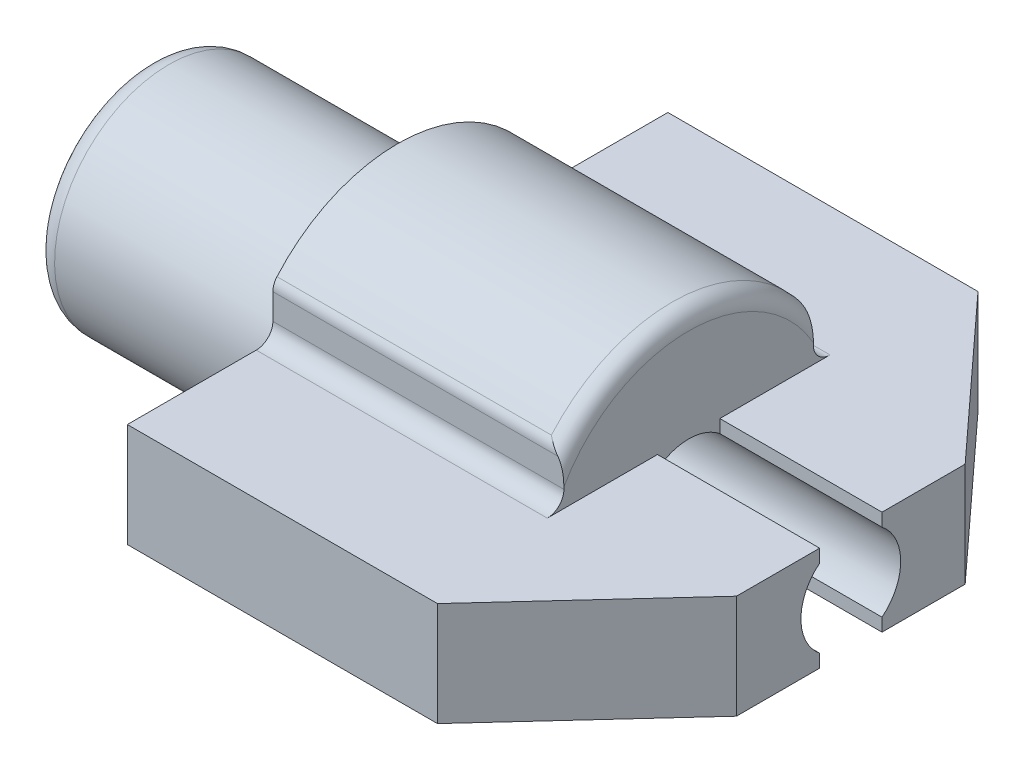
ISO-10303-21;
HEADER;
FILE_DESCRIPTION(('STEP AP214'),'2;1');
FILE_NAME('part.step','',(''),(''),'','','');
FILE_SCHEMA(('AUTOMOTIVE_DESIGN { 1 0 10303 214 1 1 1 1 }'));
ENDSEC;
DATA;
#1=APPLICATION_CONTEXT('core data for automotive mechanical design processes');
#2=APPLICATION_PROTOCOL_DEFINITION('international standard','automotive_design',2000,#1);
#3=PRODUCT_CONTEXT('',#1,'mechanical');
#4=PRODUCT('Part','Part','',(#3));
#5=PRODUCT_RELATED_PRODUCT_CATEGORY('part','',(#4));
#6=PRODUCT_DEFINITION_FORMATION('','',#4);
#7=PRODUCT_DEFINITION_CONTEXT('part definition',#1,'design');
#8=PRODUCT_DEFINITION('design','',#6,#7);
#9=PRODUCT_DEFINITION_SHAPE('','',#8);
#10=(LENGTH_UNIT() NAMED_UNIT(*) SI_UNIT(.MILLI.,.METRE.));
#11=(NAMED_UNIT(*) PLANE_ANGLE_UNIT() SI_UNIT($,.RADIAN.));
#12=(NAMED_UNIT(*) SI_UNIT($,.STERADIAN.) SOLID_ANGLE_UNIT());
#13=UNCERTAINTY_MEASURE_WITH_UNIT(LENGTH_MEASURE(1.E-05),#10,'distance_accuracy_value','');
#14=(GEOMETRIC_REPRESENTATION_CONTEXT(3) GLOBAL_UNCERTAINTY_ASSIGNED_CONTEXT((#13)) GLOBAL_UNIT_ASSIGNED_CONTEXT((#10,
#11,#12)) REPRESENTATION_CONTEXT('',''));
#15=CARTESIAN_POINT('',(0.,0.,0.));
#16=DIRECTION('',(0.,0.,1.));
#17=DIRECTION('',(1.,0.,0.));
#18=AXIS2_PLACEMENT_3D('',#15,#16,#17);
#19=CARTESIAN_POINT('',(33.8,5.5,0.));
#20=DIRECTION('',(1.,0.,0.));
#21=DIRECTION('',(0.,1.,0.));
#22=AXIS2_PLACEMENT_3D('',#19,#20,#21);
#23=PLANE('',#22);
#24=DIRECTION('',(0.,0.,-1.));
#25=VECTOR('',#24,1.);
#26=CARTESIAN_POINT('',(33.8,-2.5,13.));
#27=LINE('',#26,#25);
#28=CARTESIAN_POINT('',(33.8,-2.5,-1.5));
#29=VERTEX_POINT('',#28);
#30=CARTESIAN_POINT('',(33.8,-2.50000000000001,-5.50000000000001));
#31=VERTEX_POINT('',#30);
#32=EDGE_CURVE('E327',#29,#31,#27,.T.);
#33=ORIENTED_EDGE('',*,*,#32,.T.);
#34=DIRECTION('',(0.,1.,0.));
#35=VECTOR('',#34,1.);
#36=CARTESIAN_POINT('',(33.8,-13.2726441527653,-5.50000000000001));
#37=LINE('',#36,#35);
#38=CARTESIAN_POINT('',(33.8,2.5,-5.50000000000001));
#39=VERTEX_POINT('',#38);
#40=EDGE_CURVE('E291',#31,#39,#37,.T.);
#41=ORIENTED_EDGE('',*,*,#40,.T.);
#42=DIRECTION('',(0.,0.,-1.));
#43=VECTOR('',#42,1.);
#44=CARTESIAN_POINT('',(33.8,2.49999999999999,0.));
#45=LINE('',#44,#43);
#46=CARTESIAN_POINT('',(33.8,2.5,-1.5));
#47=VERTEX_POINT('',#46);
#48=EDGE_CURVE('E345',#47,#39,#45,.T.);
#49=ORIENTED_EDGE('',*,*,#48,.F.);
#50=DIRECTION('',(0.,1.,0.));
#51=VECTOR('',#50,1.);
#52=CARTESIAN_POINT('',(33.8,5.5,-1.5));
#53=LINE('',#52,#51);
#54=CARTESIAN_POINT('',(33.8,1.87349939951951,-1.5));
#55=VERTEX_POINT('',#54);
#56=EDGE_CURVE('E314',#55,#47,#53,.T.);
#57=ORIENTED_EDGE('',*,*,#56,.F.);
#58=CARTESIAN_POINT('',(33.8,0.,0.));
#59=DIRECTION('',(1.,0.,0.));
#60=DIRECTION('',(0.,1.,0.));
#61=AXIS2_PLACEMENT_3D('',#58,#59,#60);
#62=CIRCLE('',#61,2.4);
#63=CARTESIAN_POINT('',(33.8,-1.87349939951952,-1.5));
#64=VERTEX_POINT('',#63);
#65=EDGE_CURVE('E324',#64,#55,#62,.T.);
#66=ORIENTED_EDGE('',*,*,#65,.F.);
#67=EDGE_CURVE('E311',#29,#64,#53,.T.);
#68=ORIENTED_EDGE('',*,*,#67,.F.);
#69=EDGE_LOOP('',(#33,#41,#49,#57,#66,#68));
#70=FACE_BOUND('',#69,.T.);
#71=ADVANCED_FACE('F33',(#70),#23,.T.);
#72=CARTESIAN_POINT('',(33.8,2.49999999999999,13.));
#73=DIRECTION('',(0.,-1.,0.));
#74=DIRECTION('',(1.,0.,0.));
#75=AXIS2_PLACEMENT_3D('',#72,#73,#74);
#76=PLANE('',#75);
#77=ORIENTED_EDGE('',*,*,#48,.T.);
#78=DIRECTION('',(-0.676117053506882,0.,-0.736794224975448));
#79=VECTOR('',#78,1.);
#80=CARTESIAN_POINT('',(26.9176470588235,2.5,-13.));
#81=LINE('',#80,#79);
#82=CARTESIAN_POINT('',(26.9176470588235,2.5,-13.));
#83=VERTEX_POINT('',#82);
#84=EDGE_CURVE('E288',#39,#83,#81,.T.);
#85=ORIENTED_EDGE('',*,*,#84,.T.);
#86=DIRECTION('',(-1.,0.,0.));
#87=VECTOR('',#86,1.);
#88=CARTESIAN_POINT('',(33.8,2.49999999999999,-13.));
#89=LINE('',#88,#87);
#90=CARTESIAN_POINT('',(12.,2.5,-13.));
#91=VERTEX_POINT('',#90);
#92=EDGE_CURVE('E380',#83,#91,#89,.T.);
#93=ORIENTED_EDGE('',*,*,#92,.T.);
#94=DIRECTION('',(0.,0.,1.));
#95=VECTOR('',#94,1.);
#96=CARTESIAN_POINT('',(12.,2.5,-13.));
#97=LINE('',#96,#95);
#98=CARTESIAN_POINT('',(12.,2.5,-6.8));
#99=VERTEX_POINT('',#98);
#100=EDGE_CURVE('E366',#91,#99,#97,.T.);
#101=ORIENTED_EDGE('',*,*,#100,.T.);
#102=DIRECTION('',(-1.,0.,0.));
#103=VECTOR('',#102,1.);
#104=CARTESIAN_POINT('',(26.,2.5,-6.8));
#105=LINE('',#104,#103);
#106=CARTESIAN_POINT('',(26.,2.5,-6.8));
#107=VERTEX_POINT('',#106);
#108=EDGE_CURVE('E456',#99,#107,#105,.F.);
#109=ORIENTED_EDGE('',*,*,#108,.T.);
#110=DIRECTION('',(0.,0.,-1.));
#111=VECTOR('',#110,1.);
#112=CARTESIAN_POINT('',(26.,2.5,13.));
#113=LINE('',#112,#111);
#114=CARTESIAN_POINT('',(26.,2.5,-1.5));
#115=VERTEX_POINT('',#114);
#116=EDGE_CURVE('E337',#115,#107,#113,.T.);
#117=ORIENTED_EDGE('',*,*,#116,.F.);
#118=DIRECTION('',(-1.,0.,0.));
#119=VECTOR('',#118,1.);
#120=CARTESIAN_POINT('',(41.6,2.49999999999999,-1.5));
#121=LINE('',#120,#119);
#122=EDGE_CURVE('E297',#47,#115,#121,.T.);
#123=ORIENTED_EDGE('',*,*,#122,.F.);
#124=EDGE_LOOP('',(#77,#85,#93,#101,#109,#117,#123));
#125=FACE_BOUND('',#124,.T.);
#126=ADVANCED_FACE('F437',(#125),#76,.F.);
#127=CARTESIAN_POINT('',(33.8,-2.50000000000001,13.));
#128=DIRECTION('',(0.,1.,0.));
#129=DIRECTION('',(-1.,0.,0.));
#130=AXIS2_PLACEMENT_3D('',#127,#128,#129);
#131=PLANE('',#130);
#132=DIRECTION('',(-1.,0.,0.));
#133=VECTOR('',#132,1.);
#134=CARTESIAN_POINT('',(33.8,-2.50000000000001,-1.5));
#135=LINE('',#134,#133);
#136=CARTESIAN_POINT('',(26.2,-2.50000000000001,-1.5));
#137=VERTEX_POINT('',#136);
#138=EDGE_CURVE('E313',#29,#137,#135,.T.);
#139=ORIENTED_EDGE('',*,*,#138,.T.);
#140=DIRECTION('',(0.,0.,-1.));
#141=VECTOR('',#140,1.);
#142=CARTESIAN_POINT('',(26.2,-2.50000000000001,-6.));
#143=LINE('',#142,#141);
#144=CARTESIAN_POINT('',(26.2,-2.50000000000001,-6.2));
#145=VERTEX_POINT('',#144);
#146=EDGE_CURVE('E612',#137,#145,#143,.T.);
#147=ORIENTED_EDGE('',*,*,#146,.T.);
#148=DIRECTION('',(-1.,0.,0.));
#149=VECTOR('',#148,1.);
#150=CARTESIAN_POINT('',(12.,-2.5,-6.2));
#151=LINE('',#150,#149);
#152=CARTESIAN_POINT('',(12.,-2.5,-6.2));
#153=VERTEX_POINT('',#152);
#154=EDGE_CURVE('E614',#145,#153,#151,.T.);
#155=ORIENTED_EDGE('',*,*,#154,.T.);
#156=DIRECTION('',(0.,0.,-1.));
#157=VECTOR('',#156,1.);
#158=CARTESIAN_POINT('',(12.,-2.5,-13.));
#159=LINE('',#158,#157);
#160=CARTESIAN_POINT('',(12.,-2.5,-13.));
#161=VERTEX_POINT('',#160);
#162=EDGE_CURVE('E374',#153,#161,#159,.T.);
#163=ORIENTED_EDGE('',*,*,#162,.T.);
#164=DIRECTION('',(-1.,0.,0.));
#165=VECTOR('',#164,1.);
#166=CARTESIAN_POINT('',(33.8,-2.50000000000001,-13.));
#167=LINE('',#166,#165);
#168=CARTESIAN_POINT('',(26.9176470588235,-2.50000000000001,-13.));
#169=VERTEX_POINT('',#168);
#170=EDGE_CURVE('E379',#169,#161,#167,.T.);
#171=ORIENTED_EDGE('',*,*,#170,.F.);
#172=DIRECTION('',(0.676117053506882,0.,0.736794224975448));
#173=VECTOR('',#172,1.);
#174=CARTESIAN_POINT('',(26.9176470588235,-2.50000000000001,-13.));
#175=LINE('',#174,#173);
#176=EDGE_CURVE('E283',#169,#31,#175,.T.);
#177=ORIENTED_EDGE('',*,*,#176,.T.);
#178=ORIENTED_EDGE('',*,*,#32,.F.);
#179=EDGE_LOOP('',(#139,#147,#155,#163,#171,#177,#178));
#180=FACE_BOUND('',#179,.T.);
#181=ADVANCED_FACE('F542',(#180),#131,.F.);
#182=CARTESIAN_POINT('',(0.,0.,0.));
#183=DIRECTION('',(-1.,0.,0.));
#184=DIRECTION('',(0.,-1.,0.));
#185=AXIS2_PLACEMENT_3D('',#182,#183,#184);
#186=PLANE('',#185);
#187=DIRECTION('',(0.,0.,-1.));
#188=VECTOR('',#187,1.);
#189=CARTESIAN_POINT('',(0.,-4.,-6.24819974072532));
#190=LINE('',#189,#188);
#191=CARTESIAN_POINT('',(0.,-4.,2.06155281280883));
#192=VERTEX_POINT('',#191);
#193=CARTESIAN_POINT('',(0.,-4.,-2.06155281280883));
#194=VERTEX_POINT('',#193);
#195=EDGE_CURVE('E351',#192,#194,#190,.T.);
#196=ORIENTED_EDGE('',*,*,#195,.F.);
#197=CARTESIAN_POINT('',(0.,0.,0.));
#198=DIRECTION('',(-1.,0.,0.));
#199=DIRECTION('',(0.,-1.,0.));
#200=AXIS2_PLACEMENT_3D('',#197,#198,#199);
#201=CIRCLE('',#200,4.5);
#202=EDGE_CURVE('E521',#192,#194,#201,.T.);
#203=ORIENTED_EDGE('',*,*,#202,.T.);
#204=EDGE_LOOP('',(#196,#203));
#205=FACE_BOUND('',#204,.T.);
#206=ADVANCED_FACE('F621',(#205),#186,.T.);
#207=CARTESIAN_POINT('',(33.8,0.,0.));
#208=DIRECTION('',(1.,0.,0.));
#209=DIRECTION('',(0.,1.,0.));
#210=AXIS2_PLACEMENT_3D('',#207,#208,#209);
#211=CYLINDRICAL_SURFACE('',#210,5.5);
#212=DIRECTION('',(1.,0.,0.));
#213=VECTOR('',#212,1.);
#214=CARTESIAN_POINT('',(33.8,-4.00000000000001,-3.77491721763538));
#215=LINE('',#214,#213);
#216=CARTESIAN_POINT('',(1.,-4.,-3.77491721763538));
#217=VERTEX_POINT('',#216);
#218=CARTESIAN_POINT('',(12.,-4.,-3.77491721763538));
#219=VERTEX_POINT('',#218);
#220=EDGE_CURVE('E357',#217,#219,#215,.T.);
#221=ORIENTED_EDGE('',*,*,#220,.F.);
#222=CARTESIAN_POINT('',(1.,0.,0.));
#223=DIRECTION('',(-1.,0.,0.));
#224=DIRECTION('',(0.,-1.,0.));
#225=AXIS2_PLACEMENT_3D('',#222,#223,#224);
#226=CIRCLE('',#225,5.5);
#227=CARTESIAN_POINT('',(1.,-4.,3.77491721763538));
#228=VERTEX_POINT('',#227);
#229=EDGE_CURVE('E626',#217,#228,#226,.F.);
#230=ORIENTED_EDGE('',*,*,#229,.T.);
#231=DIRECTION('',(1.,0.,0.));
#232=VECTOR('',#231,1.);
#233=CARTESIAN_POINT('',(33.8,-4.00000000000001,3.77491721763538));
#234=LINE('',#233,#232);
#235=CARTESIAN_POINT('',(12.,-4.,3.77491721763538));
#236=VERTEX_POINT('',#235);
#237=EDGE_CURVE('E363',#236,#228,#234,.F.);
#238=ORIENTED_EDGE('',*,*,#237,.F.);
#239=CARTESIAN_POINT('',(12.,0.,0.));
#240=DIRECTION('',(1.,0.,0.));
#241=DIRECTION('',(0.,1.,0.));
#242=AXIS2_PLACEMENT_3D('',#239,#240,#241);
#243=CIRCLE('',#242,5.5);
#244=EDGE_CURVE('E263',#219,#236,#243,.T.);
#245=ORIENTED_EDGE('',*,*,#244,.F.);
#246=EDGE_LOOP('',(#221,#230,#238,#245));
#247=FACE_BOUND('',#246,.T.);
#248=ADVANCED_FACE('F562',(#247),#211,.T.);
#249=CARTESIAN_POINT('',(12.,5.5,0.));
#250=DIRECTION('',(-1.,0.,0.));
#251=DIRECTION('',(0.,-1.,0.));
#252=AXIS2_PLACEMENT_3D('',#249,#250,#251);
#253=PLANE('',#252);
#254=CARTESIAN_POINT('',(12.,0.,0.));
#255=DIRECTION('',(-1.,0.,0.));
#256=DIRECTION('',(0.,-1.,0.));
#257=AXIS2_PLACEMENT_3D('',#254,#255,#256);
#258=CIRCLE('',#257,7.7);
#259=CARTESIAN_POINT('',(12.,5.06126154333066,-5.80289855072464));
#260=VERTEX_POINT('',#259);
#261=CARTESIAN_POINT('',(12.,5.06126154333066,5.80289855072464));
#262=VERTEX_POINT('',#261);
#263=EDGE_CURVE('E348',#260,#262,#258,.F.);
#264=ORIENTED_EDGE('',*,*,#263,.F.);
#265=CARTESIAN_POINT('',(12.,4.53541618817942,-5.2));
#266=DIRECTION('',(-1.,0.,0.));
#267=DIRECTION('',(0.,-1.,0.));
#268=AXIS2_PLACEMENT_3D('',#265,#266,#267);
#269=CIRCLE('',#268,0.8);
#270=CARTESIAN_POINT('',(12.,4.53541618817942,-6.));
#271=VERTEX_POINT('',#270);
#272=EDGE_CURVE('E454',#260,#271,#269,.T.);
#273=ORIENTED_EDGE('',*,*,#272,.T.);
#274=DIRECTION('',(0.,1.,0.));
#275=VECTOR('',#274,1.);
#276=CARTESIAN_POINT('',(12.,2.5,-6.));
#277=LINE('',#276,#275);
#278=CARTESIAN_POINT('',(12.,3.3,-6.));
#279=VERTEX_POINT('',#278);
#280=EDGE_CURVE('E369',#279,#271,#277,.T.);
#281=ORIENTED_EDGE('',*,*,#280,.F.);
#282=CARTESIAN_POINT('',(12.,3.3,-6.8));
#283=DIRECTION('',(-1.,0.,0.));
#284=DIRECTION('',(0.,-1.,0.));
#285=AXIS2_PLACEMENT_3D('',#282,#283,#284);
#286=CIRCLE('',#285,0.8);
#287=EDGE_CURVE('E466',#279,#99,#286,.F.);
#288=ORIENTED_EDGE('',*,*,#287,.T.);
#289=ORIENTED_EDGE('',*,*,#100,.F.);
#290=DIRECTION('',(0.,1.,0.));
#291=VECTOR('',#290,1.);
#292=CARTESIAN_POINT('',(12.,2.5,-13.));
#293=LINE('',#292,#291);
#294=EDGE_CURVE('E376',#161,#91,#293,.T.);
#295=ORIENTED_EDGE('',*,*,#294,.F.);
#296=ORIENTED_EDGE('',*,*,#162,.F.);
#297=CARTESIAN_POINT('',(12.,-2.7,-6.2));
#298=DIRECTION('',(-1.,0.,0.));
#299=DIRECTION('',(0.,-1.,0.));
#300=AXIS2_PLACEMENT_3D('',#297,#298,#299);
#301=CIRCLE('',#300,0.2);
#302=CARTESIAN_POINT('',(12.,-2.7,-6.));
#303=VERTEX_POINT('',#302);
#304=EDGE_CURVE('E11',#153,#303,#301,.F.);
#305=ORIENTED_EDGE('',*,*,#304,.T.);
#306=DIRECTION('',(0.,1.,0.));
#307=VECTOR('',#306,1.);
#308=CARTESIAN_POINT('',(12.,-2.5,-6.));
#309=LINE('',#308,#307);
#310=CARTESIAN_POINT('',(12.,-4.00000000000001,-6.));
#311=VERTEX_POINT('',#310);
#312=EDGE_CURVE('E372',#311,#303,#309,.T.);
#313=ORIENTED_EDGE('',*,*,#312,.F.);
#314=DIRECTION('',(0.,0.,-1.));
#315=VECTOR('',#314,1.);
#316=CARTESIAN_POINT('',(12.,-4.,0.));
#317=LINE('',#316,#315);
#318=EDGE_CURVE('E354',#219,#311,#317,.T.);
#319=ORIENTED_EDGE('',*,*,#318,.F.);
#320=ORIENTED_EDGE('',*,*,#244,.T.);
#321=CARTESIAN_POINT('',(12.,-4.,6.));
#322=VERTEX_POINT('',#321);
#323=EDGE_CURVE('E358',#322,#236,#317,.T.);
#324=ORIENTED_EDGE('',*,*,#323,.F.);
#325=DIRECTION('',(0.,-1.,0.));
#326=VECTOR('',#325,1.);
#327=CARTESIAN_POINT('',(12.,-2.5,6.));
#328=LINE('',#327,#326);
#329=CARTESIAN_POINT('',(12.,-2.7,6.));
#330=VERTEX_POINT('',#329);
#331=EDGE_CURVE('E389',#330,#322,#328,.T.);
#332=ORIENTED_EDGE('',*,*,#331,.F.);
#333=CARTESIAN_POINT('',(12.,-2.7,6.2));
#334=DIRECTION('',(-1.,0.,0.));
#335=DIRECTION('',(0.,-1.,0.));
#336=AXIS2_PLACEMENT_3D('',#333,#334,#335);
#337=CIRCLE('',#336,0.2);
#338=CARTESIAN_POINT('',(12.,-2.5,6.2));
#339=VERTEX_POINT('',#338);
#340=EDGE_CURVE('E42',#330,#339,#337,.F.);
#341=ORIENTED_EDGE('',*,*,#340,.T.);
#342=DIRECTION('',(0.,0.,-1.));
#343=VECTOR('',#342,1.);
#344=CARTESIAN_POINT('',(12.,-2.5,13.));
#345=LINE('',#344,#343);
#346=CARTESIAN_POINT('',(12.,-2.5,13.));
#347=VERTEX_POINT('',#346);
#348=EDGE_CURVE('E386',#347,#339,#345,.T.);
#349=ORIENTED_EDGE('',*,*,#348,.F.);
#350=DIRECTION('',(0.,-1.,0.));
#351=VECTOR('',#350,1.);
#352=CARTESIAN_POINT('',(12.,2.5,13.));
#353=LINE('',#352,#351);
#354=CARTESIAN_POINT('',(12.,2.5,13.));
#355=VERTEX_POINT('',#354);
#356=EDGE_CURVE('E382',#355,#347,#353,.T.);
#357=ORIENTED_EDGE('',*,*,#356,.F.);
#358=DIRECTION('',(0.,0.,1.));
#359=VECTOR('',#358,1.);
#360=CARTESIAN_POINT('',(12.,2.5,13.));
#361=LINE('',#360,#359);
#362=CARTESIAN_POINT('',(12.,2.5,6.8));
#363=VERTEX_POINT('',#362);
#364=EDGE_CURVE('E259',#363,#355,#361,.T.);
#365=ORIENTED_EDGE('',*,*,#364,.F.);
#366=CARTESIAN_POINT('',(12.,3.3,6.8));
#367=DIRECTION('',(-1.,0.,0.));
#368=DIRECTION('',(0.,-1.,0.));
#369=AXIS2_PLACEMENT_3D('',#366,#367,#368);
#370=CIRCLE('',#369,0.8);
#371=CARTESIAN_POINT('',(12.,3.3,6.));
#372=VERTEX_POINT('',#371);
#373=EDGE_CURVE('E461',#363,#372,#370,.F.);
#374=ORIENTED_EDGE('',*,*,#373,.T.);
#375=DIRECTION('',(0.,-1.,0.));
#376=VECTOR('',#375,1.);
#377=CARTESIAN_POINT('',(12.,2.5,6.));
#378=LINE('',#377,#376);
#379=CARTESIAN_POINT('',(12.,4.53541618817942,6.));
#380=VERTEX_POINT('',#379);
#381=EDGE_CURVE('E391',#380,#372,#378,.T.);
#382=ORIENTED_EDGE('',*,*,#381,.F.);
#383=CARTESIAN_POINT('',(12.,4.53541618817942,5.2));
#384=DIRECTION('',(-1.,0.,0.));
#385=DIRECTION('',(0.,-1.,0.));
#386=AXIS2_PLACEMENT_3D('',#383,#384,#385);
#387=CIRCLE('',#386,0.8);
#388=EDGE_CURVE('E451',#380,#262,#387,.T.);
#389=ORIENTED_EDGE('',*,*,#388,.T.);
#390=EDGE_LOOP('',(#264,#273,#281,#288,#289,#295,#296,#305,#313,#319,#320,#324,#332,#341,#349,
#357,#365,#374,#382,#389));
#391=FACE_BOUND('',#390,.T.);
#392=ADVANCED_FACE('F555',(#391),#253,.T.);
#393=CARTESIAN_POINT('',(33.8,2.49999999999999,5.50000000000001));
#394=VERTEX_POINT('',#393);
#395=CARTESIAN_POINT('',(33.8,2.5,1.5));
#396=VERTEX_POINT('',#395);
#397=EDGE_CURVE('E346',#394,#396,#45,.T.);
#398=ORIENTED_EDGE('',*,*,#397,.F.);
#399=DIRECTION('',(0.,1.,0.));
#400=VECTOR('',#399,1.);
#401=CARTESIAN_POINT('',(33.8,-13.2726441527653,5.5));
#402=LINE('',#401,#400);
#403=CARTESIAN_POINT('',(33.8,-2.50000000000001,5.5));
#404=VERTEX_POINT('',#403);
#405=EDGE_CURVE('E272',#404,#394,#402,.T.);
#406=ORIENTED_EDGE('',*,*,#405,.F.);
#407=CARTESIAN_POINT('',(33.8,-2.5,1.5));
#408=VERTEX_POINT('',#407);
#409=EDGE_CURVE('E328',#404,#408,#27,.T.);
#410=ORIENTED_EDGE('',*,*,#409,.T.);
#411=DIRECTION('',(0.,-1.,0.));
#412=VECTOR('',#411,1.);
#413=CARTESIAN_POINT('',(33.8,5.5,1.5));
#414=LINE('',#413,#412);
#415=CARTESIAN_POINT('',(33.8,-1.87349939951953,1.5));
#416=VERTEX_POINT('',#415);
#417=EDGE_CURVE('E308',#416,#408,#414,.T.);
#418=ORIENTED_EDGE('',*,*,#417,.F.);
#419=CARTESIAN_POINT('',(33.8,1.87349939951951,1.5));
#420=VERTEX_POINT('',#419);
#421=EDGE_CURVE('E321',#420,#416,#62,.T.);
#422=ORIENTED_EDGE('',*,*,#421,.F.);
#423=EDGE_CURVE('E306',#396,#420,#414,.T.);
#424=ORIENTED_EDGE('',*,*,#423,.F.);
#425=EDGE_LOOP('',(#398,#406,#410,#418,#422,#424));
#426=FACE_BOUND('',#425,.T.);
#427=ADVANCED_FACE('F546',(#426),#23,.T.);
#428=CARTESIAN_POINT('',(33.8,2.49999999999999,13.));
#429=DIRECTION('',(0.,0.,-1.));
#430=DIRECTION('',(-1.,0.,0.));
#431=AXIS2_PLACEMENT_3D('',#428,#429,#430);
#432=PLANE('',#431);
#433=DIRECTION('',(-1.,0.,0.));
#434=VECTOR('',#433,1.);
#435=CARTESIAN_POINT('',(33.8,-2.50000000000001,13.));
#436=LINE('',#435,#434);
#437=CARTESIAN_POINT('',(26.9176470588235,-2.5,13.));
#438=VERTEX_POINT('',#437);
#439=EDGE_CURVE('E264',#438,#347,#436,.T.);
#440=ORIENTED_EDGE('',*,*,#439,.F.);
#441=DIRECTION('',(0.,1.,0.));
#442=VECTOR('',#441,1.);
#443=CARTESIAN_POINT('',(26.9176470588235,-13.2726441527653,13.));
#444=LINE('',#443,#442);
#445=CARTESIAN_POINT('',(26.9176470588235,2.5,13.));
#446=VERTEX_POINT('',#445);
#447=EDGE_CURVE('E267',#438,#446,#444,.T.);
#448=ORIENTED_EDGE('',*,*,#447,.T.);
#449=DIRECTION('',(-1.,0.,0.));
#450=VECTOR('',#449,1.);
#451=CARTESIAN_POINT('',(33.8,2.49999999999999,13.));
#452=LINE('',#451,#450);
#453=EDGE_CURVE('E251',#446,#355,#452,.T.);
#454=ORIENTED_EDGE('',*,*,#453,.T.);
#455=ORIENTED_EDGE('',*,*,#356,.T.);
#456=EDGE_LOOP('',(#440,#448,#454,#455));
#457=FACE_BOUND('',#456,.T.);
#458=ADVANCED_FACE('F268',(#457),#432,.F.);
#459=ORIENTED_EDGE('',*,*,#453,.F.);
#460=DIRECTION('',(0.676117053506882,0.,-0.736794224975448));
#461=VECTOR('',#460,1.);
#462=CARTESIAN_POINT('',(33.8,2.49999999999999,5.50000000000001));
#463=LINE('',#462,#461);
#464=EDGE_CURVE('E256',#446,#394,#463,.T.);
#465=ORIENTED_EDGE('',*,*,#464,.T.);
#466=ORIENTED_EDGE('',*,*,#397,.T.);
#467=DIRECTION('',(1.,0.,0.));
#468=VECTOR('',#467,1.);
#469=CARTESIAN_POINT('',(41.6,2.49999999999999,1.5));
#470=LINE('',#469,#468);
#471=CARTESIAN_POINT('',(26.,2.5,1.5));
#472=VERTEX_POINT('',#471);
#473=EDGE_CURVE('E286',#472,#396,#470,.T.);
#474=ORIENTED_EDGE('',*,*,#473,.F.);
#475=CARTESIAN_POINT('',(26.,2.5,6.8));
#476=VERTEX_POINT('',#475);
#477=EDGE_CURVE('E339',#476,#472,#113,.T.);
#478=ORIENTED_EDGE('',*,*,#477,.F.);
#479=DIRECTION('',(-1.,0.,0.));
#480=VECTOR('',#479,1.);
#481=CARTESIAN_POINT('',(12.,2.5,6.8));
#482=LINE('',#481,#480);
#483=EDGE_CURVE('E459',#476,#363,#482,.T.);
#484=ORIENTED_EDGE('',*,*,#483,.T.);
#485=ORIENTED_EDGE('',*,*,#364,.T.);
#486=EDGE_LOOP('',(#459,#465,#466,#474,#478,#484,#485));
#487=FACE_BOUND('',#486,.T.);
#488=ADVANCED_FACE('F253',(#487),#76,.F.);
#489=CARTESIAN_POINT('',(33.8,2.49999999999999,6.));
#490=DIRECTION('',(0.,0.,-1.));
#491=DIRECTION('',(-1.,0.,0.));
#492=AXIS2_PLACEMENT_3D('',#489,#490,#491);
#493=PLANE('',#492);
#494=DIRECTION('',(0.,1.,0.));
#495=VECTOR('',#494,1.);
#496=CARTESIAN_POINT('',(26.,2.49999999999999,6.));
#497=LINE('',#496,#495);
#498=CARTESIAN_POINT('',(26.,3.3,6.));
#499=VERTEX_POINT('',#498);
#500=CARTESIAN_POINT('',(26.,3.40734500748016,6.));
#501=VERTEX_POINT('',#500);
#502=EDGE_CURVE('E342',#499,#501,#497,.T.);
#503=ORIENTED_EDGE('',*,*,#502,.T.);
#504=CARTESIAN_POINT('',(26.,3.40734500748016,6.));
#505=CARTESIAN_POINT('',(25.9999679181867,3.47615601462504,6.));
#506=CARTESIAN_POINT('',(25.9978301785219,3.54503136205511,6.));
#507=CARTESIAN_POINT('',(25.9885117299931,3.68277942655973,6.));
#508=CARTESIAN_POINT('',(25.9813056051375,3.75165037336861,6.));
#509=CARTESIAN_POINT('',(25.9613781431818,3.88602084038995,6.));
#510=CARTESIAN_POINT('',(25.948870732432,3.95155081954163,6.));
#511=CARTESIAN_POINT('',(25.9174407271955,4.08094941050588,6.));
#512=CARTESIAN_POINT('',(25.898531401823,4.1448211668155,6.));
#513=CARTESIAN_POINT('',(25.8547972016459,4.26505050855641,6.));
#514=CARTESIAN_POINT('',(25.8305405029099,4.32160784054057,6.));
#515=CARTESIAN_POINT('',(25.7881509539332,4.40393489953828,6.));
#516=CARTESIAN_POINT('',(25.7728674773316,4.43117475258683,6.));
#517=CARTESIAN_POINT('',(25.7401062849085,4.48435994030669,6.));
#518=CARTESIAN_POINT('',(25.7226248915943,4.5103030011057,6.));
#519=CARTESIAN_POINT('',(25.7039667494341,4.53541618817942,6.));
#520=B_SPLINE_CURVE_WITH_KNOTS('',3,(#504,#505,#506,#507,#508,#509,#510,#511,#512,#513,#514,
#515,#516,#517,#518,#519),.UNSPECIFIED.,.F.,.F.,(4,2,2,2,2,2,2,4),(0.,0.206499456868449,
0.414041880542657,0.613905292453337,0.813356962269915,0.997438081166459,1.0910485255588,
1.18481773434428),.UNSPECIFIED.);
#521=CARTESIAN_POINT('',(25.7039667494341,4.53541618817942,6.));
#522=VERTEX_POINT('',#521);
#523=EDGE_CURVE('E445',#501,#522,#520,.T.);
#524=ORIENTED_EDGE('',*,*,#523,.T.);
#525=DIRECTION('',(-1.,0.,0.));
#526=VECTOR('',#525,1.);
#527=CARTESIAN_POINT('',(33.8,4.53541618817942,6.));
#528=LINE('',#527,#526);
#529=EDGE_CURVE('E452',#522,#380,#528,.T.);
#530=ORIENTED_EDGE('',*,*,#529,.T.);
#531=ORIENTED_EDGE('',*,*,#381,.T.);
#532=DIRECTION('',(-1.,0.,0.));
#533=VECTOR('',#532,1.);
#534=CARTESIAN_POINT('',(26.,3.3,6.));
#535=LINE('',#534,#533);
#536=EDGE_CURVE('E994',#372,#499,#535,.F.);
#537=ORIENTED_EDGE('',*,*,#536,.T.);
#538=EDGE_LOOP('',(#503,#524,#530,#531,#537));
#539=FACE_BOUND('',#538,.T.);
#540=ADVANCED_FACE('F436',(#539),#493,.F.);
#541=CARTESIAN_POINT('',(33.8,-2.50000000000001,6.));
#542=DIRECTION('',(0.,0.,-1.));
#543=DIRECTION('',(-1.,0.,0.));
#544=AXIS2_PLACEMENT_3D('',#541,#542,#543);
#545=PLANE('',#544);
#546=DIRECTION('',(0.,1.,0.));
#547=VECTOR('',#546,1.);
#548=CARTESIAN_POINT('',(26.,-2.50000000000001,6.));
#549=LINE('',#548,#547);
#550=CARTESIAN_POINT('',(26.,-4.00000000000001,6.));
#551=VERTEX_POINT('',#550);
#552=CARTESIAN_POINT('',(26.,-2.70000000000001,6.));
#553=VERTEX_POINT('',#552);
#554=EDGE_CURVE('E331',#551,#553,#549,.T.);
#555=ORIENTED_EDGE('',*,*,#554,.T.);
#556=DIRECTION('',(-1.,0.,0.));
#557=VECTOR('',#556,1.);
#558=CARTESIAN_POINT('',(12.,-2.7,6.));
#559=LINE('',#558,#557);
#560=EDGE_CURVE('E56',#553,#330,#559,.T.);
#561=ORIENTED_EDGE('',*,*,#560,.T.);
#562=ORIENTED_EDGE('',*,*,#331,.T.);
#563=DIRECTION('',(1.,0.,0.));
#564=VECTOR('',#563,1.);
#565=CARTESIAN_POINT('',(33.8,-4.00000000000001,6.));
#566=LINE('',#565,#564);
#567=EDGE_CURVE('E360',#322,#551,#566,.T.);
#568=ORIENTED_EDGE('',*,*,#567,.T.);
#569=EDGE_LOOP('',(#555,#561,#562,#568));
#570=FACE_BOUND('',#569,.T.);
#571=ADVANCED_FACE('F441',(#570),#545,.F.);
#572=DIRECTION('',(-1.,0.,0.));
#573=VECTOR('',#572,1.);
#574=CARTESIAN_POINT('',(26.,-2.50000000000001,6.2));
#575=LINE('',#574,#573);
#576=CARTESIAN_POINT('',(26.2,-2.50000000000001,6.2));
#577=VERTEX_POINT('',#576);
#578=EDGE_CURVE('E580',#339,#577,#575,.F.);
#579=ORIENTED_EDGE('',*,*,#578,.T.);
#580=DIRECTION('',(0.,0.,-1.));
#581=VECTOR('',#580,1.);
#582=CARTESIAN_POINT('',(26.2,-2.50000000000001,1.5));
#583=LINE('',#582,#581);
#584=CARTESIAN_POINT('',(26.2,-2.50000000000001,1.5));
#585=VERTEX_POINT('',#584);
#586=EDGE_CURVE('E585',#577,#585,#583,.T.);
#587=ORIENTED_EDGE('',*,*,#586,.T.);
#588=DIRECTION('',(1.,0.,0.));
#589=VECTOR('',#588,1.);
#590=CARTESIAN_POINT('',(33.8,-2.50000000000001,1.5));
#591=LINE('',#590,#589);
#592=EDGE_CURVE('E309',#585,#408,#591,.T.);
#593=ORIENTED_EDGE('',*,*,#592,.T.);
#594=ORIENTED_EDGE('',*,*,#409,.F.);
#595=DIRECTION('',(-0.676117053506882,0.,0.736794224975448));
#596=VECTOR('',#595,1.);
#597=CARTESIAN_POINT('',(33.8,-2.50000000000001,5.5));
#598=LINE('',#597,#596);
#599=EDGE_CURVE('E281',#404,#438,#598,.T.);
#600=ORIENTED_EDGE('',*,*,#599,.T.);
#601=ORIENTED_EDGE('',*,*,#439,.T.);
#602=ORIENTED_EDGE('',*,*,#348,.T.);
#603=EDGE_LOOP('',(#579,#587,#593,#594,#600,#601,#602));
#604=FACE_BOUND('',#603,.T.);
#605=ADVANCED_FACE('F532',(#604),#131,.F.);
#606=CARTESIAN_POINT('',(33.8,2.49999999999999,-13.));
#607=DIRECTION('',(0.,0.,1.));
#608=DIRECTION('',(1.,0.,0.));
#609=AXIS2_PLACEMENT_3D('',#606,#607,#608);
#610=PLANE('',#609);
#611=ORIENTED_EDGE('',*,*,#92,.F.);
#612=DIRECTION('',(0.,1.,0.));
#613=VECTOR('',#612,1.);
#614=CARTESIAN_POINT('',(26.9176470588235,-13.2726441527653,-13.));
#615=LINE('',#614,#613);
#616=EDGE_CURVE('E287',#169,#83,#615,.T.);
#617=ORIENTED_EDGE('',*,*,#616,.F.);
#618=ORIENTED_EDGE('',*,*,#170,.T.);
#619=ORIENTED_EDGE('',*,*,#294,.T.);
#620=EDGE_LOOP('',(#611,#617,#618,#619));
#621=FACE_BOUND('',#620,.T.);
#622=ADVANCED_FACE('F529',(#621),#610,.F.);
#623=CARTESIAN_POINT('',(33.8,-2.50000000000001,-6.));
#624=DIRECTION('',(0.,0.,1.));
#625=DIRECTION('',(1.,0.,0.));
#626=AXIS2_PLACEMENT_3D('',#623,#624,#625);
#627=PLANE('',#626);
#628=ORIENTED_EDGE('',*,*,#312,.T.);
#629=DIRECTION('',(-1.,0.,0.));
#630=VECTOR('',#629,1.);
#631=CARTESIAN_POINT('',(26.,-2.70000000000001,-6.));
#632=LINE('',#631,#630);
#633=CARTESIAN_POINT('',(26.,-2.70000000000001,-6.));
#634=VERTEX_POINT('',#633);
#635=EDGE_CURVE('E595',#303,#634,#632,.F.);
#636=ORIENTED_EDGE('',*,*,#635,.T.);
#637=DIRECTION('',(0.,1.,0.));
#638=VECTOR('',#637,1.);
#639=CARTESIAN_POINT('',(26.,-2.5,-6.));
#640=LINE('',#639,#638);
#641=CARTESIAN_POINT('',(26.,-4.00000000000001,-6.));
#642=VERTEX_POINT('',#641);
#643=EDGE_CURVE('E320',#642,#634,#640,.T.);
#644=ORIENTED_EDGE('',*,*,#643,.F.);
#645=DIRECTION('',(-1.,0.,0.));
#646=VECTOR('',#645,1.);
#647=CARTESIAN_POINT('',(33.8,-4.00000000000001,-6.));
#648=LINE('',#647,#646);
#649=EDGE_CURVE('E398',#642,#311,#648,.T.);
#650=ORIENTED_EDGE('',*,*,#649,.T.);
#651=EDGE_LOOP('',(#628,#636,#644,#650));
#652=FACE_BOUND('',#651,.T.);
#653=ADVANCED_FACE('F431',(#652),#627,.F.);
#654=CARTESIAN_POINT('',(33.8,2.49999999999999,-6.));
#655=DIRECTION('',(0.,0.,1.));
#656=DIRECTION('',(1.,0.,0.));
#657=AXIS2_PLACEMENT_3D('',#654,#655,#656);
#658=PLANE('',#657);
#659=DIRECTION('',(-1.,0.,0.));
#660=VECTOR('',#659,1.);
#661=CARTESIAN_POINT('',(33.8,4.53541618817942,-6.));
#662=LINE('',#661,#660);
#663=CARTESIAN_POINT('',(25.7039667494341,4.53541618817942,-6.));
#664=VERTEX_POINT('',#663);
#665=EDGE_CURVE('E410',#271,#664,#662,.F.);
#666=ORIENTED_EDGE('',*,*,#665,.T.);
#667=CARTESIAN_POINT('',(25.7039667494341,4.53541618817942,-6.));
#668=CARTESIAN_POINT('',(25.724441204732,4.50785312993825,-6.));
#669=CARTESIAN_POINT('',(25.7434981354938,4.47929879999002,-6.));
#670=CARTESIAN_POINT('',(25.7789770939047,4.42067245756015,-6.));
#671=CARTESIAN_POINT('',(25.7954045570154,4.39060374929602,-6.));
#672=CARTESIAN_POINT('',(25.84061553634,4.29973537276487,-6.));
#673=CARTESIAN_POINT('',(25.8660390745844,4.23726117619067,-6.));
#674=CARTESIAN_POINT('',(25.9081405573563,4.1132342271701,-6.));
#675=CARTESIAN_POINT('',(25.9252112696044,4.05180875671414,-6.));
#676=CARTESIAN_POINT('',(25.9536237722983,3.92756812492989,-6.));
#677=CARTESIAN_POINT('',(25.9649567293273,3.86475097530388,-6.));
#678=CARTESIAN_POINT('',(25.9830071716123,3.73620088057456,-6.));
#679=CARTESIAN_POINT('',(25.9895456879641,3.67044383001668,-6.));
#680=CARTESIAN_POINT('',(25.9980197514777,3.53888827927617,-6.));
#681=CARTESIAN_POINT('',(25.9999735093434,3.47309098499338,-6.));
#682=CARTESIAN_POINT('',(26.,3.40734500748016,-6.));
#683=B_SPLINE_CURVE_WITH_KNOTS('',3,(#667,#668,#669,#670,#671,#672,#673,#674,#675,#676,#677,
#678,#679,#680,#681,#682),.UNSPECIFIED.,.F.,.F.,(4,2,2,2,2,2,2,4),(0.,0.102886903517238,
0.205558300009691,0.407232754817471,0.598196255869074,0.789452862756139,0.987528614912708,
1.1848162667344),.UNSPECIFIED.);
#684=CARTESIAN_POINT('',(26.,3.40734500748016,-6.));
#685=VERTEX_POINT('',#684);
#686=EDGE_CURVE('E412',#664,#685,#683,.T.);
#687=ORIENTED_EDGE('',*,*,#686,.T.);
#688=DIRECTION('',(0.,1.,0.));
#689=VECTOR('',#688,1.);
#690=CARTESIAN_POINT('',(26.,2.5,-6.));
#691=LINE('',#690,#689);
#692=CARTESIAN_POINT('',(26.,3.3,-6.));
#693=VERTEX_POINT('',#692);
#694=EDGE_CURVE('E334',#693,#685,#691,.T.);
#695=ORIENTED_EDGE('',*,*,#694,.F.);
#696=DIRECTION('',(-1.,0.,0.));
#697=VECTOR('',#696,1.);
#698=CARTESIAN_POINT('',(12.,3.3,-6.));
#699=LINE('',#698,#697);
#700=EDGE_CURVE('E407',#693,#279,#699,.T.);
#701=ORIENTED_EDGE('',*,*,#700,.T.);
#702=ORIENTED_EDGE('',*,*,#280,.T.);
#703=EDGE_LOOP('',(#666,#687,#695,#701,#702));
#704=FACE_BOUND('',#703,.T.);
#705=ADVANCED_FACE('F425',(#704),#658,.F.);
#706=CARTESIAN_POINT('',(33.8,-4.00000000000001,-6.24819974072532));
#707=DIRECTION('',(0.,1.,0.));
#708=DIRECTION('',(-1.,0.,0.));
#709=AXIS2_PLACEMENT_3D('',#706,#707,#708);
#710=PLANE('',#709);
#711=ORIENTED_EDGE('',*,*,#237,.T.);
#712=CARTESIAN_POINT('',(1.,-4.,3.77491721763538));
#713=CARTESIAN_POINT('',(0.978339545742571,-4.,3.77492070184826));
#714=CARTESIAN_POINT('',(0.956692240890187,-4.,3.77389094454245));
#715=CARTESIAN_POINT('',(0.913603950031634,-4.,3.76980797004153));
#716=CARTESIAN_POINT('',(0.892162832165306,-4.,3.76675614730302));
#717=CARTESIAN_POINT('',(0.828750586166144,-4.,3.75470153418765));
#718=CARTESIAN_POINT('',(0.787300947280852,-4.,3.74279785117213));
#719=CARTESIAN_POINT('',(0.707211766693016,-4.,3.71211198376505));
#720=CARTESIAN_POINT('',(0.668565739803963,-4.,3.69334632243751));
#721=CARTESIAN_POINT('',(0.594612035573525,-4.,3.65001532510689));
#722=CARTESIAN_POINT('',(0.559311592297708,-4.,3.62543780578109));
#723=CARTESIAN_POINT('',(0.479738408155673,-4.,3.5613706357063));
#724=CARTESIAN_POINT('',(0.437170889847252,-4.,3.51976703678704));
#725=CARTESIAN_POINT('',(0.359296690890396,-4.,3.43032018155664));
#726=CARTESIAN_POINT('',(0.323998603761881,-4.,3.38246964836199));
#727=CARTESIAN_POINT('',(0.244800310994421,-4.,3.25845475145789));
#728=CARTESIAN_POINT('',(0.204922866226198,-4.,3.17973783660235));
#729=CARTESIAN_POINT('',(0.137543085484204,-4.,3.01687089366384));
#730=CARTESIAN_POINT('',(0.110115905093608,-4.,2.93269128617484));
#731=CARTESIAN_POINT('',(0.0710236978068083,-4.,2.78263858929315));
#732=CARTESIAN_POINT('',(0.0571449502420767,-4.,2.7173167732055));
#733=CARTESIAN_POINT('',(0.0343638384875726,-4.,2.58575060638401));
#734=CARTESIAN_POINT('',(0.025466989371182,-4.,2.51950531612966));
#735=CARTESIAN_POINT('',(0.0119904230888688,-4.,2.38795329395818));
#736=CARTESIAN_POINT('',(0.00732710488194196,-4.,2.32265464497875));
#737=CARTESIAN_POINT('',(0.0013416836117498,-4.,2.19207634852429));
#738=CARTESIAN_POINT('',(1.05401002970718E-05,-4.,2.12679713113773));
#739=CARTESIAN_POINT('',(0.,-4.,2.06155281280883));
#740=B_SPLINE_CURVE_WITH_KNOTS('',3,(#712,#713,#714,#715,#716,#717,#718,#719,#720,#721,#722,
#723,#724,#725,#726,#727,#728,#729,#730,#731,#732,#733,#734,#735,#736,#737,#738,#739),
.UNSPECIFIED.,.F.,.F.,(4,2,2,2,2,2,2,2,2,2,2,2,2,4),(0.,0.0649318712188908,0.129819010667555,
0.258442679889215,0.386758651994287,0.515346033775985,0.692921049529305,0.87070479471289,
1.13395888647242,1.39878163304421,1.5989139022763,1.79926728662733,1.9955722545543,
2.19134405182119),.UNSPECIFIED.);
#741=EDGE_CURVE('E516',#228,#192,#740,.T.);
#742=ORIENTED_EDGE('',*,*,#741,.T.);
#743=ORIENTED_EDGE('',*,*,#195,.T.);
#744=CARTESIAN_POINT('',(0.,-4.,-2.06155281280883));
#745=CARTESIAN_POINT('',(3.01821797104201E-05,-4.,-2.14518309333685));
#746=CARTESIAN_POINT('',(0.00220734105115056,-4.,-2.22892369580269));
#747=CARTESIAN_POINT('',(0.0123677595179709,-4.,-2.39669670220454));
#748=CARTESIAN_POINT('',(0.0203966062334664,-4.,-2.48072621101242));
#749=CARTESIAN_POINT('',(0.0440123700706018,-4.,-2.64919126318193));
#750=CARTESIAN_POINT('',(0.0597218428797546,-4.,-2.73361061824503));
#751=CARTESIAN_POINT('',(0.100569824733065,-4.,-2.89993642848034));
#752=CARTESIAN_POINT('',(0.125674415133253,-4.,-2.98185079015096));
#753=CARTESIAN_POINT('',(0.177431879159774,-4.,-3.11555451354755));
#754=CARTESIAN_POINT('',(0.200975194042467,-4.,-3.16854060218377));
#755=CARTESIAN_POINT('',(0.253981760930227,-4.,-3.27136863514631));
#756=CARTESIAN_POINT('',(0.283431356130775,-4.,-3.32121749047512));
#757=CARTESIAN_POINT('',(0.349218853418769,-4.,-3.41693341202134));
#758=CARTESIAN_POINT('',(0.385621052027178,-4.,-3.46275696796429));
#759=CARTESIAN_POINT('',(0.465528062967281,-4.,-3.54782007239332));
#760=CARTESIAN_POINT('',(0.509025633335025,-4.,-3.58706625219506));
#761=CARTESIAN_POINT('',(0.590950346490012,-4.,-3.64756347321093));
#762=CARTESIAN_POINT('',(0.627867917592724,-4.,-3.6708542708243));
#763=CARTESIAN_POINT('',(0.704976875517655,-4.,-3.71107767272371));
#764=CARTESIAN_POINT('',(0.745160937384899,-4.,-3.72802405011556));
#765=CARTESIAN_POINT('',(0.820895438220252,-4.,-3.75224310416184));
#766=CARTESIAN_POINT('',(0.856077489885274,-4.,-3.76066828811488));
#767=CARTESIAN_POINT('',(0.927486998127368,-4.,-3.77204281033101));
#768=CARTESIAN_POINT('',(0.963718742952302,-4.,-3.77496503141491));
#769=CARTESIAN_POINT('',(1.,-4.,-3.77491721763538));
#770=B_SPLINE_CURVE_WITH_KNOTS('',3,(#744,#745,#746,#747,#748,#749,#750,#751,#752,#753,#754,
#755,#756,#757,#758,#759,#760,#761,#762,#763,#764,#765,#766,#767,#768,#769),.UNSPECIFIED.,.F.,
.F.,(4,2,2,2,2,2,2,2,2,2,2,2,4),(0.,0.251033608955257,0.504044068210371,0.761230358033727,
1.01749696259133,1.19112909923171,1.36436428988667,1.53928674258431,1.71403176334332,
1.84448228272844,1.97464794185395,2.08276083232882,2.1914050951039),.UNSPECIFIED.);
#771=EDGE_CURVE('E509',#194,#217,#770,.T.);
#772=ORIENTED_EDGE('',*,*,#771,.T.);
#773=ORIENTED_EDGE('',*,*,#220,.T.);
#774=ORIENTED_EDGE('',*,*,#318,.T.);
#775=ORIENTED_EDGE('',*,*,#649,.F.);
#776=DIRECTION('',(0.,0.,1.));
#777=VECTOR('',#776,1.);
#778=CARTESIAN_POINT('',(26.,-4.00000000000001,-6.24819974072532));
#779=LINE('',#778,#777);
#780=EDGE_CURVE('E470',#642,#551,#779,.T.);
#781=ORIENTED_EDGE('',*,*,#780,.T.);
#782=ORIENTED_EDGE('',*,*,#567,.F.);
#783=ORIENTED_EDGE('',*,*,#323,.T.);
#784=EDGE_LOOP('',(#711,#742,#743,#772,#773,#774,#775,#781,#782,#783));
#785=FACE_BOUND('',#784,.T.);
#786=ADVANCED_FACE('F430',(#785),#710,.F.);
#787=CARTESIAN_POINT('',(33.8,0.,0.));
#788=DIRECTION('',(-1.,0.,0.));
#789=DIRECTION('',(0.,-1.,0.));
#790=AXIS2_PLACEMENT_3D('',#787,#788,#789);
#791=CYLINDRICAL_SURFACE('',#790,7.7);
#792=CARTESIAN_POINT('',(25.2,0.,0.));
#793=DIRECTION('',(-1.,0.,0.));
#794=DIRECTION('',(0.,0.,1.));
#795=AXIS2_PLACEMENT_3D('',#792,#793,#794);
#796=CIRCLE('',#795,7.7);
#797=CARTESIAN_POINT('',(25.2,5.06126154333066,5.80289855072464));
#798=VERTEX_POINT('',#797);
#799=CARTESIAN_POINT('',(25.2,5.06126154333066,-5.80289855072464));
#800=VERTEX_POINT('',#799);
#801=EDGE_CURVE('E402',#798,#800,#796,.T.);
#802=ORIENTED_EDGE('',*,*,#801,.T.);
#803=DIRECTION('',(-1.,0.,0.));
#804=VECTOR('',#803,1.);
#805=CARTESIAN_POINT('',(33.8,5.06126154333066,-5.80289855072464));
#806=LINE('',#805,#804);
#807=EDGE_CURVE('E405',#800,#260,#806,.T.);
#808=ORIENTED_EDGE('',*,*,#807,.T.);
#809=ORIENTED_EDGE('',*,*,#263,.T.);
#810=DIRECTION('',(-1.,0.,0.));
#811=VECTOR('',#810,1.);
#812=CARTESIAN_POINT('',(33.8,5.06126154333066,5.80289855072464));
#813=LINE('',#812,#811);
#814=EDGE_CURVE('E400',#262,#798,#813,.F.);
#815=ORIENTED_EDGE('',*,*,#814,.T.);
#816=EDGE_LOOP('',(#802,#808,#809,#815));
#817=FACE_BOUND('',#816,.T.);
#818=ADVANCED_FACE('F526',(#817),#791,.T.);
#819=CARTESIAN_POINT('',(26.,2.5,13.));
#820=DIRECTION('',(-1.,0.,0.));
#821=DIRECTION('',(0.,0.,1.));
#822=AXIS2_PLACEMENT_3D('',#819,#820,#821);
#823=PLANE('',#822);
#824=ORIENTED_EDGE('',*,*,#694,.T.);
#825=CARTESIAN_POINT('',(26.,0.,0.));
#826=DIRECTION('',(-1.,0.,0.));
#827=DIRECTION('',(0.,0.,1.));
#828=AXIS2_PLACEMENT_3D('',#825,#826,#827);
#829=CIRCLE('',#828,6.9);
#830=EDGE_CURVE('E419',#685,#501,#829,.F.);
#831=ORIENTED_EDGE('',*,*,#830,.T.);
#832=ORIENTED_EDGE('',*,*,#502,.F.);
#833=CARTESIAN_POINT('',(26.,3.3,6.8));
#834=DIRECTION('',(-1.,0.,0.));
#835=DIRECTION('',(0.,0.,1.));
#836=AXIS2_PLACEMENT_3D('',#833,#834,#835);
#837=CIRCLE('',#836,0.8);
#838=EDGE_CURVE('E463',#499,#476,#837,.T.);
#839=ORIENTED_EDGE('',*,*,#838,.T.);
#840=ORIENTED_EDGE('',*,*,#477,.T.);
#841=DIRECTION('',(0.,1.,0.));
#842=VECTOR('',#841,1.);
#843=CARTESIAN_POINT('',(26.,-4.00000000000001,1.5));
#844=LINE('',#843,#842);
#845=CARTESIAN_POINT('',(26.,1.87349939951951,1.5));
#846=VERTEX_POINT('',#845);
#847=EDGE_CURVE('E300',#846,#472,#844,.T.);
#848=ORIENTED_EDGE('',*,*,#847,.F.);
#849=CARTESIAN_POINT('',(26.,0.,0.));
#850=DIRECTION('',(-1.,0.,0.));
#851=DIRECTION('',(0.,-1.,0.));
#852=AXIS2_PLACEMENT_3D('',#849,#850,#851);
#853=CIRCLE('',#852,2.4);
#854=CARTESIAN_POINT('',(26.,1.87349939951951,-1.5));
#855=VERTEX_POINT('',#854);
#856=EDGE_CURVE('E640',#855,#846,#853,.F.);
#857=ORIENTED_EDGE('',*,*,#856,.F.);
#858=DIRECTION('',(0.,1.,0.));
#859=VECTOR('',#858,1.);
#860=CARTESIAN_POINT('',(26.,-4.00000000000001,-1.5));
#861=LINE('',#860,#859);
#862=EDGE_CURVE('E301',#855,#115,#861,.T.);
#863=ORIENTED_EDGE('',*,*,#862,.T.);
#864=ORIENTED_EDGE('',*,*,#116,.T.);
#865=CARTESIAN_POINT('',(26.,3.3,-6.8));
#866=DIRECTION('',(-1.,0.,0.));
#867=DIRECTION('',(0.,0.,1.));
#868=AXIS2_PLACEMENT_3D('',#865,#866,#867);
#869=CIRCLE('',#868,0.8);
#870=EDGE_CURVE('E468',#107,#693,#869,.T.);
#871=ORIENTED_EDGE('',*,*,#870,.T.);
#872=EDGE_LOOP('',(#824,#831,#832,#839,#840,#848,#857,#863,#864,#871));
#873=FACE_BOUND('',#872,.T.);
#874=ADVANCED_FACE('F488',(#873),#823,.F.);
#875=CARTESIAN_POINT('',(33.8,4.53541618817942,5.2));
#876=DIRECTION('',(-1.,0.,0.));
#877=DIRECTION('',(0.,-1.,0.));
#878=AXIS2_PLACEMENT_3D('',#875,#876,#877);
#879=CYLINDRICAL_SURFACE('',#878,0.8);
#880=ORIENTED_EDGE('',*,*,#388,.F.);
#881=ORIENTED_EDGE('',*,*,#529,.F.);
#882=CARTESIAN_POINT('',(25.7039667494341,4.53541618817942,6.));
#883=CARTESIAN_POINT('',(25.6836819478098,4.56269709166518,5.99999384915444));
#884=CARTESIAN_POINT('',(25.6629225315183,4.58958680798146,5.99860490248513));
#885=CARTESIAN_POINT('',(25.6206357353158,4.64246007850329,5.99325246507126));
#886=CARTESIAN_POINT('',(25.59910897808,4.66844433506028,5.98929101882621));
#887=CARTESIAN_POINT('',(25.5337060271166,4.74479336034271,5.97385564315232));
#888=CARTESIAN_POINT('',(25.4889067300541,4.79368826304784,5.95882877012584));
#889=CARTESIAN_POINT('',(25.4041949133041,4.88034795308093,5.92312640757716));
#890=CARTESIAN_POINT('',(25.36444583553,4.91872224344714,5.90349631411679));
#891=CARTESIAN_POINT('',(25.2844895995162,4.99146987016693,5.85866198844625));
#892=CARTESIAN_POINT('',(25.2442830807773,5.02584818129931,5.83346480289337));
#893=CARTESIAN_POINT('',(25.2027387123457,5.05907863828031,5.8047972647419));
#894=CARTESIAN_POINT('',(25.2013693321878,5.0601713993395,5.80384936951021));
#895=CARTESIAN_POINT('',(25.2,5.06126154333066,5.80289855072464));
#896=B_SPLINE_CURVE_WITH_KNOTS('',3,(#882,#883,#884,#885,#886,#887,#888,#889,#890,#891,#892,
#893,#894,#895),.UNSPECIFIED.,.F.,.F.,(4,2,2,2,2,2,4),(0.,0.101902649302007,0.203724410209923,
0.406871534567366,0.582406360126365,0.757720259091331,0.76369606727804),.UNSPECIFIED.);
#897=EDGE_CURVE('E338',#798,#522,#896,.F.);
#898=ORIENTED_EDGE('',*,*,#897,.F.);
#899=ORIENTED_EDGE('',*,*,#814,.F.);
#900=EDGE_LOOP('',(#880,#881,#898,#899));
#901=FACE_BOUND('',#900,.T.);
#902=ADVANCED_FACE('F483',(#901),#879,.T.);
#903=CARTESIAN_POINT('',(33.8,4.53541618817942,-5.2));
#904=DIRECTION('',(-1.,0.,0.));
#905=DIRECTION('',(0.,-1.,0.));
#906=AXIS2_PLACEMENT_3D('',#903,#904,#905);
#907=CYLINDRICAL_SURFACE('',#906,0.8);
#908=ORIENTED_EDGE('',*,*,#272,.F.);
#909=ORIENTED_EDGE('',*,*,#807,.F.);
#910=CARTESIAN_POINT('',(25.7039667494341,4.53541618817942,-6.));
#911=CARTESIAN_POINT('',(25.6836819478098,4.56269709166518,-5.99999384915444));
#912=CARTESIAN_POINT('',(25.6629225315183,4.58958680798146,-5.99860490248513));
#913=CARTESIAN_POINT('',(25.6206357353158,4.64246007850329,-5.99325246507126));
#914=CARTESIAN_POINT('',(25.59910897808,4.66844433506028,-5.98929101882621));
#915=CARTESIAN_POINT('',(25.5337060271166,4.74479336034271,-5.97385564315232));
#916=CARTESIAN_POINT('',(25.4889067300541,4.79368826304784,-5.95882877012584));
#917=CARTESIAN_POINT('',(25.4041949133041,4.88034795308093,-5.92312640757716));
#918=CARTESIAN_POINT('',(25.36444583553,4.91872224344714,-5.90349631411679));
#919=CARTESIAN_POINT('',(25.2844895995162,4.99146987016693,-5.85866198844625));
#920=CARTESIAN_POINT('',(25.2442830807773,5.02584818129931,-5.83346480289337));
#921=CARTESIAN_POINT('',(25.2027387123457,5.05907863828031,-5.8047972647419));
#922=CARTESIAN_POINT('',(25.2013693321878,5.0601713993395,-5.80384936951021));
#923=CARTESIAN_POINT('',(25.2,5.06126154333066,-5.80289855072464));
#924=B_SPLINE_CURVE_WITH_KNOTS('',3,(#910,#911,#912,#913,#914,#915,#916,#917,#918,#919,#920,
#921,#922,#923),.UNSPECIFIED.,.F.,.F.,(4,2,2,2,2,2,4),(0.,0.101902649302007,0.203724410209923,
0.406871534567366,0.582406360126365,0.757720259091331,0.76369606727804),.UNSPECIFIED.);
#925=EDGE_CURVE('E333',#664,#800,#924,.T.);
#926=ORIENTED_EDGE('',*,*,#925,.F.);
#927=ORIENTED_EDGE('',*,*,#665,.F.);
#928=EDGE_LOOP('',(#908,#909,#926,#927));
#929=FACE_BOUND('',#928,.T.);
#930=ADVANCED_FACE('F480',(#929),#907,.T.);
#931=CARTESIAN_POINT('',(25.2,0.,0.));
#932=DIRECTION('',(-1.,0.,0.));
#933=DIRECTION('',(0.,0.,1.));
#934=AXIS2_PLACEMENT_3D('',#931,#932,#933);
#935=TOROIDAL_SURFACE('',#934,6.9,0.8);
#936=ORIENTED_EDGE('',*,*,#523,.F.);
#937=ORIENTED_EDGE('',*,*,#830,.F.);
#938=ORIENTED_EDGE('',*,*,#686,.F.);
#939=ORIENTED_EDGE('',*,*,#925,.T.);
#940=ORIENTED_EDGE('',*,*,#801,.F.);
#941=ORIENTED_EDGE('',*,*,#897,.T.);
#942=EDGE_LOOP('',(#936,#937,#938,#939,#940,#941));
#943=FACE_BOUND('',#942,.T.);
#944=ADVANCED_FACE('F421',(#943),#935,.T.);
#945=CARTESIAN_POINT('',(33.8,3.29999999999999,6.8));
#946=DIRECTION('',(1.,0.,0.));
#947=DIRECTION('',(0.,1.,0.));
#948=AXIS2_PLACEMENT_3D('',#945,#946,#947);
#949=CYLINDRICAL_SURFACE('',#948,0.8);
#950=ORIENTED_EDGE('',*,*,#838,.F.);
#951=ORIENTED_EDGE('',*,*,#536,.F.);
#952=ORIENTED_EDGE('',*,*,#373,.F.);
#953=ORIENTED_EDGE('',*,*,#483,.F.);
#954=EDGE_LOOP('',(#950,#951,#952,#953));
#955=FACE_BOUND('',#954,.T.);
#956=ADVANCED_FACE('F490',(#955),#949,.F.);
#957=CARTESIAN_POINT('',(33.8,3.3,-6.8));
#958=DIRECTION('',(1.,0.,0.));
#959=DIRECTION('',(0.,1.,0.));
#960=AXIS2_PLACEMENT_3D('',#957,#958,#959);
#961=CYLINDRICAL_SURFACE('',#960,0.8);
#962=ORIENTED_EDGE('',*,*,#870,.F.);
#963=ORIENTED_EDGE('',*,*,#108,.F.);
#964=ORIENTED_EDGE('',*,*,#287,.F.);
#965=ORIENTED_EDGE('',*,*,#700,.F.);
#966=EDGE_LOOP('',(#962,#963,#964,#965));
#967=FACE_BOUND('',#966,.T.);
#968=ADVANCED_FACE('F493',(#967),#961,.F.);
#969=CARTESIAN_POINT('',(26.,-2.5,13.));
#970=DIRECTION('',(-1.,0.,0.));
#971=DIRECTION('',(0.,0.,1.));
#972=AXIS2_PLACEMENT_3D('',#969,#970,#971);
#973=PLANE('',#972);
#974=ORIENTED_EDGE('',*,*,#643,.T.);
#975=DIRECTION('',(0.,0.,-1.));
#976=VECTOR('',#975,1.);
#977=CARTESIAN_POINT('',(26.,-2.70000000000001,-1.5));
#978=LINE('',#977,#976);
#979=CARTESIAN_POINT('',(26.,-2.70000000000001,-1.5));
#980=VERTEX_POINT('',#979);
#981=EDGE_CURVE('E586',#634,#980,#978,.F.);
#982=ORIENTED_EDGE('',*,*,#981,.T.);
#983=CARTESIAN_POINT('',(26.,-1.87349939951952,-1.5));
#984=VERTEX_POINT('',#983);
#985=EDGE_CURVE('E303',#980,#984,#861,.T.);
#986=ORIENTED_EDGE('',*,*,#985,.T.);
#987=CARTESIAN_POINT('',(26.,-1.87349939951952,1.5));
#988=VERTEX_POINT('',#987);
#989=EDGE_CURVE('E631',#988,#984,#853,.F.);
#990=ORIENTED_EDGE('',*,*,#989,.F.);
#991=CARTESIAN_POINT('',(26.,-2.70000000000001,1.5));
#992=VERTEX_POINT('',#991);
#993=EDGE_CURVE('E304',#992,#988,#844,.T.);
#994=ORIENTED_EDGE('',*,*,#993,.F.);
#995=DIRECTION('',(0.,0.,-1.));
#996=VECTOR('',#995,1.);
#997=CARTESIAN_POINT('',(26.,-2.70000000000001,6.));
#998=LINE('',#997,#996);
#999=EDGE_CURVE('E590',#992,#553,#998,.F.);
#1000=ORIENTED_EDGE('',*,*,#999,.T.);
#1001=ORIENTED_EDGE('',*,*,#554,.F.);
#1002=ORIENTED_EDGE('',*,*,#780,.F.);
#1003=EDGE_LOOP('',(#974,#982,#986,#990,#994,#1000,#1001,#1002));
#1004=FACE_BOUND('',#1003,.T.);
#1005=ADVANCED_FACE('F497',(#1004),#973,.F.);
#1006=CARTESIAN_POINT('',(9.8,0.,0.));
#1007=DIRECTION('',(1.,0.,0.));
#1008=DIRECTION('',(0.,1.,0.));
#1009=AXIS2_PLACEMENT_3D('',#1006,#1007,#1008);
#1010=CYLINDRICAL_SURFACE('',#1009,2.4);
#1011=CARTESIAN_POINT('',(9.8,0.,0.));
#1012=DIRECTION('',(1.,0.,0.));
#1013=DIRECTION('',(0.,1.,0.));
#1014=AXIS2_PLACEMENT_3D('',#1011,#1012,#1013);
#1015=CIRCLE('',#1014,2.4);
#1016=CARTESIAN_POINT('',(9.8,2.4,0.));
#1017=VERTEX_POINT('',#1016);
#1018=EDGE_CURVE('E317',#1017,#1017,#1015,.T.);
#1019=ORIENTED_EDGE('',*,*,#1018,.F.);
#1020=EDGE_LOOP('',(#1019));
#1021=FACE_BOUND('',#1020,.T.);
#1022=ORIENTED_EDGE('',*,*,#989,.T.);
#1023=DIRECTION('',(1.,0.,0.));
#1024=VECTOR('',#1023,1.);
#1025=CARTESIAN_POINT('',(9.8,-1.87349939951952,-1.5));
#1026=LINE('',#1025,#1024);
#1027=EDGE_CURVE('E627',#984,#64,#1026,.T.);
#1028=ORIENTED_EDGE('',*,*,#1027,.T.);
#1029=ORIENTED_EDGE('',*,*,#65,.T.);
#1030=DIRECTION('',(1.,0.,0.));
#1031=VECTOR('',#1030,1.);
#1032=CARTESIAN_POINT('',(9.8,1.87349939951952,-1.5));
#1033=LINE('',#1032,#1031);
#1034=EDGE_CURVE('E637',#55,#855,#1033,.F.);
#1035=ORIENTED_EDGE('',*,*,#1034,.T.);
#1036=ORIENTED_EDGE('',*,*,#856,.T.);
#1037=DIRECTION('',(1.,0.,0.));
#1038=VECTOR('',#1037,1.);
#1039=CARTESIAN_POINT('',(9.8,1.87349939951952,1.5));
#1040=LINE('',#1039,#1038);
#1041=EDGE_CURVE('E642',#846,#420,#1040,.T.);
#1042=ORIENTED_EDGE('',*,*,#1041,.T.);
#1043=ORIENTED_EDGE('',*,*,#421,.T.);
#1044=DIRECTION('',(1.,0.,0.));
#1045=VECTOR('',#1044,1.);
#1046=CARTESIAN_POINT('',(9.8,-1.87349939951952,1.5));
#1047=LINE('',#1046,#1045);
#1048=EDGE_CURVE('E634',#416,#988,#1047,.F.);
#1049=ORIENTED_EDGE('',*,*,#1048,.T.);
#1050=EDGE_LOOP('',(#1022,#1028,#1029,#1035,#1036,#1042,#1043,#1049));
#1051=FACE_BOUND('',#1050,.T.);
#1052=ADVANCED_FACE('F661',(#1021,#1051),#1010,.F.);
#1053=CARTESIAN_POINT('',(9.8,0.,0.));
#1054=DIRECTION('',(1.,0.,0.));
#1055=DIRECTION('',(0.,1.,0.));
#1056=AXIS2_PLACEMENT_3D('',#1053,#1054,#1055);
#1057=PLANE('',#1056);
#1058=ORIENTED_EDGE('',*,*,#1018,.T.);
#1059=EDGE_LOOP('',(#1058));
#1060=FACE_BOUND('',#1059,.T.);
#1061=ADVANCED_FACE('F668',(#1060),#1057,.T.);
#1062=CARTESIAN_POINT('',(41.6,-4.00000000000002,1.5));
#1063=DIRECTION('',(0.,0.,1.));
#1064=DIRECTION('',(0.,-1.,0.));
#1065=AXIS2_PLACEMENT_3D('',#1062,#1063,#1064);
#1066=PLANE('',#1065);
#1067=ORIENTED_EDGE('',*,*,#423,.T.);
#1068=ORIENTED_EDGE('',*,*,#1041,.F.);
#1069=ORIENTED_EDGE('',*,*,#847,.T.);
#1070=ORIENTED_EDGE('',*,*,#473,.T.);
#1071=EDGE_LOOP('',(#1067,#1068,#1069,#1070));
#1072=FACE_BOUND('',#1071,.T.);
#1073=ADVANCED_FACE('F665',(#1072),#1066,.F.);
#1074=CARTESIAN_POINT('',(41.6,-4.00000000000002,-1.5));
#1075=DIRECTION('',(0.,0.,-1.));
#1076=DIRECTION('',(0.,1.,0.));
#1077=AXIS2_PLACEMENT_3D('',#1074,#1075,#1076);
#1078=PLANE('',#1077);
#1079=ORIENTED_EDGE('',*,*,#56,.T.);
#1080=ORIENTED_EDGE('',*,*,#122,.T.);
#1081=ORIENTED_EDGE('',*,*,#862,.F.);
#1082=ORIENTED_EDGE('',*,*,#1034,.F.);
#1083=EDGE_LOOP('',(#1079,#1080,#1081,#1082));
#1084=FACE_BOUND('',#1083,.T.);
#1085=ADVANCED_FACE('F667',(#1084),#1078,.F.);
#1086=ORIENTED_EDGE('',*,*,#67,.T.);
#1087=ORIENTED_EDGE('',*,*,#1027,.F.);
#1088=ORIENTED_EDGE('',*,*,#985,.F.);
#1089=CARTESIAN_POINT('',(26.2,-2.70000000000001,-1.5));
#1090=DIRECTION('',(0.,0.,-1.));
#1091=DIRECTION('',(0.,1.,0.));
#1092=AXIS2_PLACEMENT_3D('',#1089,#1090,#1091);
#1093=CIRCLE('',#1092,0.2);
#1094=EDGE_CURVE('E597',#980,#137,#1093,.T.);
#1095=ORIENTED_EDGE('',*,*,#1094,.T.);
#1096=ORIENTED_EDGE('',*,*,#138,.F.);
#1097=EDGE_LOOP('',(#1086,#1087,#1088,#1095,#1096));
#1098=FACE_BOUND('',#1097,.T.);
#1099=ADVANCED_FACE('F674',(#1098),#1078,.F.);
#1100=ORIENTED_EDGE('',*,*,#993,.T.);
#1101=ORIENTED_EDGE('',*,*,#1048,.F.);
#1102=ORIENTED_EDGE('',*,*,#417,.T.);
#1103=ORIENTED_EDGE('',*,*,#592,.F.);
#1104=CARTESIAN_POINT('',(26.2,-2.70000000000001,1.5));
#1105=DIRECTION('',(0.,0.,1.));
#1106=DIRECTION('',(0.,-1.,0.));
#1107=AXIS2_PLACEMENT_3D('',#1104,#1105,#1106);
#1108=CIRCLE('',#1107,0.2);
#1109=EDGE_CURVE('E599',#585,#992,#1108,.T.);
#1110=ORIENTED_EDGE('',*,*,#1109,.T.);
#1111=EDGE_LOOP('',(#1100,#1101,#1102,#1103,#1110));
#1112=FACE_BOUND('',#1111,.T.);
#1113=ADVANCED_FACE('F605',(#1112),#1066,.F.);
#1114=CARTESIAN_POINT('',(26.9176470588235,-13.2726441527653,-13.));
#1115=DIRECTION('',(0.736794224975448,0.,-0.676117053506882));
#1116=DIRECTION('',(-0.676117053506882,0.,-0.736794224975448));
#1117=AXIS2_PLACEMENT_3D('',#1114,#1115,#1116);
#1118=PLANE('',#1117);
#1119=ORIENTED_EDGE('',*,*,#40,.F.);
#1120=ORIENTED_EDGE('',*,*,#176,.F.);
#1121=ORIENTED_EDGE('',*,*,#616,.T.);
#1122=ORIENTED_EDGE('',*,*,#84,.F.);
#1123=EDGE_LOOP('',(#1119,#1120,#1121,#1122));
#1124=FACE_BOUND('',#1123,.T.);
#1125=ADVANCED_FACE('F680',(#1124),#1118,.T.);
#1126=CARTESIAN_POINT('',(33.8,-13.2726441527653,5.5));
#1127=DIRECTION('',(0.736794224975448,0.,0.676117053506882));
#1128=DIRECTION('',(0.676117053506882,0.,-0.736794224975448));
#1129=AXIS2_PLACEMENT_3D('',#1126,#1127,#1128);
#1130=PLANE('',#1129);
#1131=ORIENTED_EDGE('',*,*,#405,.T.);
#1132=ORIENTED_EDGE('',*,*,#464,.F.);
#1133=ORIENTED_EDGE('',*,*,#447,.F.);
#1134=ORIENTED_EDGE('',*,*,#599,.F.);
#1135=EDGE_LOOP('',(#1131,#1132,#1133,#1134));
#1136=FACE_BOUND('',#1135,.T.);
#1137=ADVANCED_FACE('F274',(#1136),#1130,.T.);
#1138=CARTESIAN_POINT('',(1.,0.,0.));
#1139=DIRECTION('',(-1.,0.,0.));
#1140=DIRECTION('',(0.,-1.,0.));
#1141=AXIS2_PLACEMENT_3D('',#1138,#1139,#1140);
#1142=TOROIDAL_SURFACE('',#1141,4.5,1.);
#1143=ORIENTED_EDGE('',*,*,#771,.F.);
#1144=ORIENTED_EDGE('',*,*,#202,.F.);
#1145=ORIENTED_EDGE('',*,*,#741,.F.);
#1146=ORIENTED_EDGE('',*,*,#229,.F.);
#1147=EDGE_LOOP('',(#1143,#1144,#1145,#1146));
#1148=FACE_BOUND('',#1147,.T.);
#1149=ADVANCED_FACE('F499',(#1148),#1142,.T.);
#1150=CARTESIAN_POINT('',(33.8,-2.70000000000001,-6.2));
#1151=DIRECTION('',(1.,0.,0.));
#1152=DIRECTION('',(0.,1.,0.));
#1153=AXIS2_PLACEMENT_3D('',#1150,#1151,#1152);
#1154=CYLINDRICAL_SURFACE('',#1153,0.2);
#1155=ORIENTED_EDGE('',*,*,#304,.F.);
#1156=ORIENTED_EDGE('',*,*,#154,.F.);
#1157=CARTESIAN_POINT('',(26.2,-2.70000000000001,-6.2));
#1158=DIRECTION('',(0.707106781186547,0.,0.707106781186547));
#1159=DIRECTION('',(0.707106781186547,0.,-0.707106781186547));
#1160=AXIS2_PLACEMENT_3D('',#1157,#1158,#1159);
#1161=ELLIPSE('',#1160,0.282842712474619,0.2);
#1162=EDGE_CURVE('E277',#634,#145,#1161,.F.);
#1163=ORIENTED_EDGE('',*,*,#1162,.F.);
#1164=ORIENTED_EDGE('',*,*,#635,.F.);
#1165=EDGE_LOOP('',(#1155,#1156,#1163,#1164));
#1166=FACE_BOUND('',#1165,.T.);
#1167=ADVANCED_FACE('F503',(#1166),#1154,.F.);
#1168=CARTESIAN_POINT('',(26.2,-2.70000000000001,13.));
#1169=DIRECTION('',(0.,0.,1.));
#1170=DIRECTION('',(0.,-1.,0.));
#1171=AXIS2_PLACEMENT_3D('',#1168,#1169,#1170);
#1172=CYLINDRICAL_SURFACE('',#1171,0.2);
#1173=ORIENTED_EDGE('',*,*,#1094,.F.);
#1174=ORIENTED_EDGE('',*,*,#981,.F.);
#1175=ORIENTED_EDGE('',*,*,#1162,.T.);
#1176=ORIENTED_EDGE('',*,*,#146,.F.);
#1177=EDGE_LOOP('',(#1173,#1174,#1175,#1176));
#1178=FACE_BOUND('',#1177,.T.);
#1179=ADVANCED_FACE('F505',(#1178),#1172,.F.);
#1180=CARTESIAN_POINT('',(33.8,-2.70000000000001,6.2));
#1181=DIRECTION('',(1.,0.,0.));
#1182=DIRECTION('',(0.,1.,0.));
#1183=AXIS2_PLACEMENT_3D('',#1180,#1181,#1182);
#1184=CYLINDRICAL_SURFACE('',#1183,0.2);
#1185=ORIENTED_EDGE('',*,*,#340,.F.);
#1186=ORIENTED_EDGE('',*,*,#560,.F.);
#1187=CARTESIAN_POINT('',(26.2,-2.70000000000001,6.2));
#1188=DIRECTION('',(0.707106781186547,0.,-0.707106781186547));
#1189=DIRECTION('',(0.707106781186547,0.,0.707106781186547));
#1190=AXIS2_PLACEMENT_3D('',#1187,#1188,#1189);
#1191=ELLIPSE('',#1190,0.282842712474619,0.2);
#1192=EDGE_CURVE('E37',#577,#553,#1191,.F.);
#1193=ORIENTED_EDGE('',*,*,#1192,.F.);
#1194=ORIENTED_EDGE('',*,*,#578,.F.);
#1195=EDGE_LOOP('',(#1185,#1186,#1193,#1194));
#1196=FACE_BOUND('',#1195,.T.);
#1197=ADVANCED_FACE('F35',(#1196),#1184,.F.);
#1198=CARTESIAN_POINT('',(26.2,-2.70000000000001,13.));
#1199=DIRECTION('',(0.,0.,1.));
#1200=DIRECTION('',(0.,-1.,0.));
#1201=AXIS2_PLACEMENT_3D('',#1198,#1199,#1200);
#1202=CYLINDRICAL_SURFACE('',#1201,0.2);
#1203=ORIENTED_EDGE('',*,*,#1192,.T.);
#1204=ORIENTED_EDGE('',*,*,#999,.F.);
#1205=ORIENTED_EDGE('',*,*,#1109,.F.);
#1206=ORIENTED_EDGE('',*,*,#586,.F.);
#1207=EDGE_LOOP('',(#1203,#1204,#1205,#1206));
#1208=FACE_BOUND('',#1207,.T.);
#1209=ADVANCED_FACE('F609',(#1208),#1202,.F.);
#1210=CLOSED_SHELL('',(#71,#126,#181,#206,#248,#392,#427,#458,#488,#540,#571,#605,#622,#653,
#705,#786,#818,#874,#902,#930,#944,#956,#968,#1005,#1052,#1061,#1073,#1085,#1099,#1113,#1125,
#1137,#1149,#1167,#1179,#1197,#1209));
#1211=MANIFOLD_SOLID_BREP('B2',#1210);
#1212=ADVANCED_BREP_SHAPE_REPRESENTATION('',(#18,#1211),#14);
#1213=SHAPE_DEFINITION_REPRESENTATION(#9,#1212);
ENDSEC;
END-ISO-10303-21;
